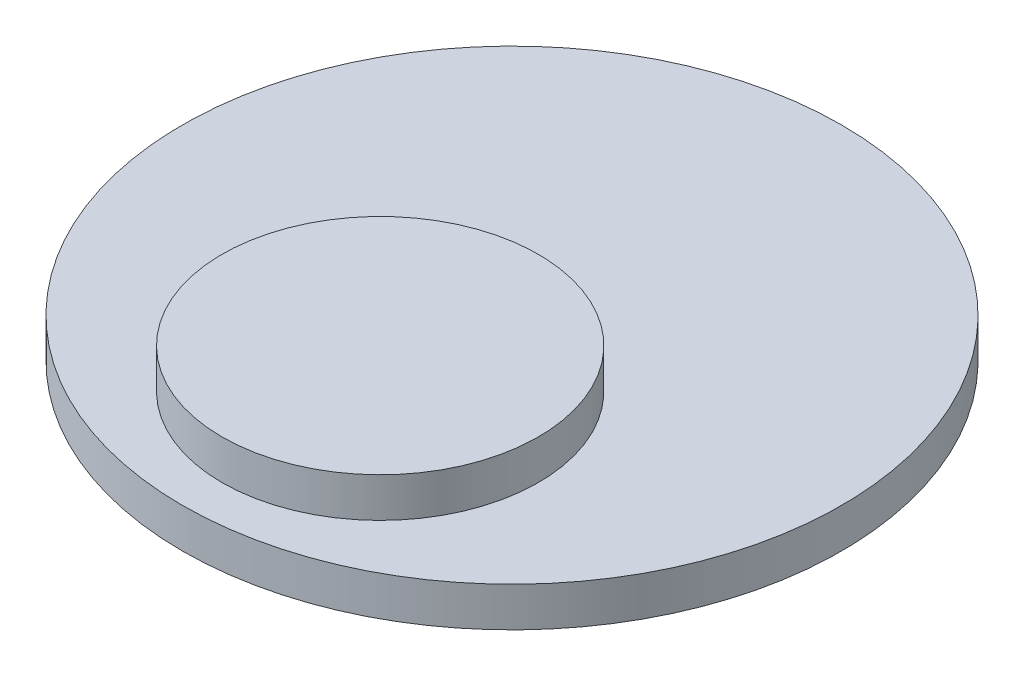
ISO-10303-21;
HEADER;
FILE_DESCRIPTION(('STEP AP214'),'2;1');
FILE_NAME('part.step','',(''),(''),'','','');
FILE_SCHEMA(('AUTOMOTIVE_DESIGN { 1 0 10303 214 1 1 1 1 }'));
ENDSEC;
DATA;
#1=APPLICATION_CONTEXT('core data for automotive mechanical design processes');
#2=APPLICATION_PROTOCOL_DEFINITION('international standard','automotive_design',2000,#1);
#3=PRODUCT_CONTEXT('',#1,'mechanical');
#4=PRODUCT('Part','Part','',(#3));
#5=PRODUCT_RELATED_PRODUCT_CATEGORY('part','',(#4));
#6=PRODUCT_DEFINITION_FORMATION('','',#4);
#7=PRODUCT_DEFINITION_CONTEXT('part definition',#1,'design');
#8=PRODUCT_DEFINITION('design','',#6,#7);
#9=PRODUCT_DEFINITION_SHAPE('','',#8);
#10=(LENGTH_UNIT() NAMED_UNIT(*) SI_UNIT(.MILLI.,.METRE.));
#11=(NAMED_UNIT(*) PLANE_ANGLE_UNIT() SI_UNIT($,.RADIAN.));
#12=(NAMED_UNIT(*) SI_UNIT($,.STERADIAN.) SOLID_ANGLE_UNIT());
#13=UNCERTAINTY_MEASURE_WITH_UNIT(LENGTH_MEASURE(1.E-05),#10,'distance_accuracy_value','');
#14=(GEOMETRIC_REPRESENTATION_CONTEXT(3) GLOBAL_UNCERTAINTY_ASSIGNED_CONTEXT((#13)) GLOBAL_UNIT_ASSIGNED_CONTEXT((#10,
#11,#12)) REPRESENTATION_CONTEXT('',''));
#15=CARTESIAN_POINT('',(0.,0.,0.));
#16=DIRECTION('',(0.,0.,1.));
#17=DIRECTION('',(1.,0.,0.));
#18=AXIS2_PLACEMENT_3D('',#15,#16,#17);
#19=CARTESIAN_POINT('',(0.,1.5,0.));
#20=DIRECTION('',(0.,-1.,0.));
#21=DIRECTION('',(0.,0.,-1.));
#22=AXIS2_PLACEMENT_3D('',#19,#20,#21);
#23=CYLINDRICAL_SURFACE('',#22,12.5);
#24=CARTESIAN_POINT('',(0.,1.5,0.));
#25=DIRECTION('',(0.,1.,0.));
#26=DIRECTION('',(0.,0.,1.));
#27=AXIS2_PLACEMENT_3D('',#24,#25,#26);
#28=CIRCLE('',#27,12.5);
#29=CARTESIAN_POINT('',(0.,1.5,12.5));
#30=VERTEX_POINT('',#29);
#31=EDGE_CURVE('E10',#30,#30,#28,.T.);
#32=ORIENTED_EDGE('',*,*,#31,.F.);
#33=EDGE_LOOP('',(#32));
#34=FACE_BOUND('',#33,.T.);
#35=CARTESIAN_POINT('',(0.,0.,0.));
#36=DIRECTION('',(0.,1.,0.));
#37=DIRECTION('',(0.,0.,1.));
#38=AXIS2_PLACEMENT_3D('',#35,#36,#37);
#39=CIRCLE('',#38,12.5);
#40=CARTESIAN_POINT('',(0.,0.,12.5));
#41=VERTEX_POINT('',#40);
#42=EDGE_CURVE('E39',#41,#41,#39,.T.);
#43=ORIENTED_EDGE('',*,*,#42,.T.);
#44=EDGE_LOOP('',(#43));
#45=FACE_BOUND('',#44,.T.);
#46=ADVANCED_FACE('F36',(#34,#45),#23,.T.);
#47=CARTESIAN_POINT('',(0.,1.5,0.));
#48=DIRECTION('',(0.,1.,0.));
#49=DIRECTION('',(0.,0.,1.));
#50=AXIS2_PLACEMENT_3D('',#47,#48,#49);
#51=PLANE('',#50);
#52=CARTESIAN_POINT('',(0.,1.5,5.));
#53=DIRECTION('',(0.,1.,0.));
#54=DIRECTION('',(0.,0.,1.));
#55=AXIS2_PLACEMENT_3D('',#52,#53,#54);
#56=CIRCLE('',#55,6.);
#57=CARTESIAN_POINT('',(0.,1.5,11.));
#58=VERTEX_POINT('',#57);
#59=EDGE_CURVE('E48',#58,#58,#56,.T.);
#60=ORIENTED_EDGE('',*,*,#59,.F.);
#61=EDGE_LOOP('',(#60));
#62=FACE_BOUND('',#61,.T.);
#63=ORIENTED_EDGE('',*,*,#31,.T.);
#64=EDGE_LOOP('',(#63));
#65=FACE_BOUND('',#64,.T.);
#66=ADVANCED_FACE('F63',(#62,#65),#51,.T.);
#67=CARTESIAN_POINT('',(0.,0.,0.));
#68=DIRECTION('',(0.,1.,0.));
#69=DIRECTION('',(0.,0.,1.));
#70=AXIS2_PLACEMENT_3D('',#67,#68,#69);
#71=PLANE('',#70);
#72=ORIENTED_EDGE('',*,*,#42,.F.);
#73=EDGE_LOOP('',(#72));
#74=FACE_BOUND('',#73,.T.);
#75=ADVANCED_FACE('F59',(#74),#71,.F.);
#76=CARTESIAN_POINT('',(0.,3.,5.));
#77=DIRECTION('',(0.,-1.,0.));
#78=DIRECTION('',(0.,0.,-1.));
#79=AXIS2_PLACEMENT_3D('',#76,#77,#78);
#80=CYLINDRICAL_SURFACE('',#79,6.);
#81=CARTESIAN_POINT('',(0.,3.,5.));
#82=DIRECTION('',(0.,1.,0.));
#83=DIRECTION('',(0.,0.,1.));
#84=AXIS2_PLACEMENT_3D('',#81,#82,#83);
#85=CIRCLE('',#84,6.);
#86=CARTESIAN_POINT('',(0.,3.,11.));
#87=VERTEX_POINT('',#86);
#88=EDGE_CURVE('E46',#87,#87,#85,.T.);
#89=ORIENTED_EDGE('',*,*,#88,.F.);
#90=EDGE_LOOP('',(#89));
#91=FACE_BOUND('',#90,.T.);
#92=ORIENTED_EDGE('',*,*,#59,.T.);
#93=EDGE_LOOP('',(#92));
#94=FACE_BOUND('',#93,.T.);
#95=ADVANCED_FACE('F56',(#91,#94),#80,.T.);
#96=CARTESIAN_POINT('',(0.,3.,5.));
#97=DIRECTION('',(0.,1.,0.));
#98=DIRECTION('',(0.,0.,1.));
#99=AXIS2_PLACEMENT_3D('',#96,#97,#98);
#100=PLANE('',#99);
#101=ORIENTED_EDGE('',*,*,#88,.T.);
#102=EDGE_LOOP('',(#101));
#103=FACE_BOUND('',#102,.T.);
#104=ADVANCED_FACE('F54',(#103),#100,.T.);
#105=CLOSED_SHELL('',(#46,#66,#75,#95,#104));
#106=MANIFOLD_SOLID_BREP('B2',#105);
#107=ADVANCED_BREP_SHAPE_REPRESENTATION('',(#18,#106),#14);
#108=SHAPE_DEFINITION_REPRESENTATION(#9,#107);
ENDSEC;
END-ISO-10303-21;
